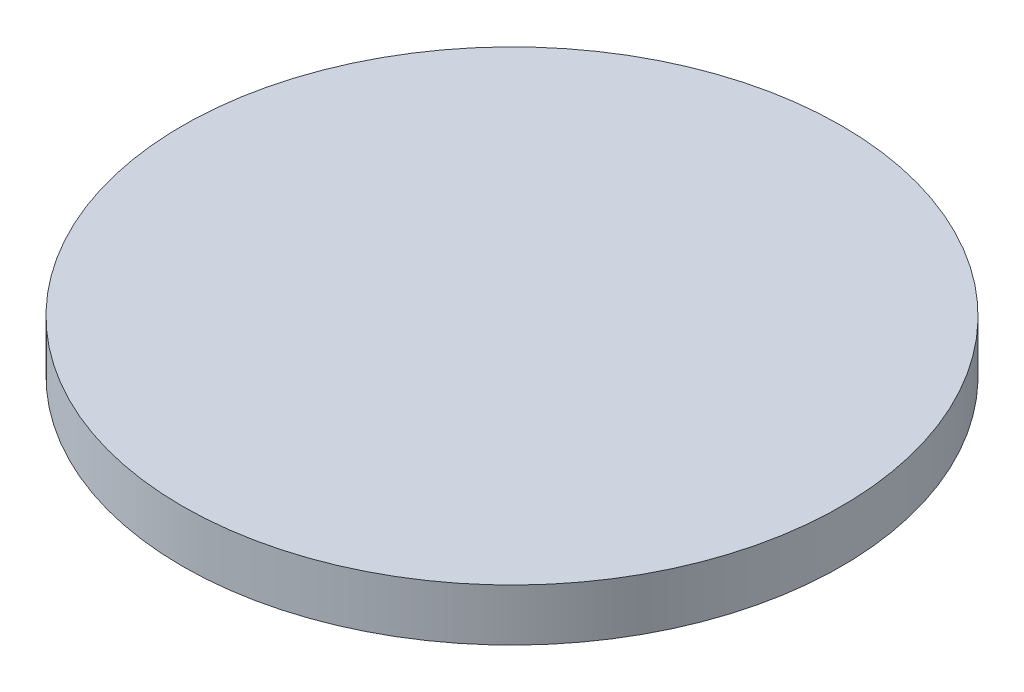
ISO-10303-21;
HEADER;
FILE_DESCRIPTION(('STEP AP214'),'2;1');
FILE_NAME('part.step','',(''),(''),'','','');
FILE_SCHEMA(('AUTOMOTIVE_DESIGN { 1 0 10303 214 1 1 1 1 }'));
ENDSEC;
DATA;
#1=APPLICATION_CONTEXT('core data for automotive mechanical design processes');
#2=APPLICATION_PROTOCOL_DEFINITION('international standard','automotive_design',2000,#1);
#3=PRODUCT_CONTEXT('',#1,'mechanical');
#4=PRODUCT('Part','Part','',(#3));
#5=PRODUCT_RELATED_PRODUCT_CATEGORY('part','',(#4));
#6=PRODUCT_DEFINITION_FORMATION('','',#4);
#7=PRODUCT_DEFINITION_CONTEXT('part definition',#1,'design');
#8=PRODUCT_DEFINITION('design','',#6,#7);
#9=PRODUCT_DEFINITION_SHAPE('','',#8);
#10=(LENGTH_UNIT() NAMED_UNIT(*) SI_UNIT(.MILLI.,.METRE.));
#11=(NAMED_UNIT(*) PLANE_ANGLE_UNIT() SI_UNIT($,.RADIAN.));
#12=(NAMED_UNIT(*) SI_UNIT($,.STERADIAN.) SOLID_ANGLE_UNIT());
#13=UNCERTAINTY_MEASURE_WITH_UNIT(LENGTH_MEASURE(1.E-05),#10,'distance_accuracy_value','');
#14=(GEOMETRIC_REPRESENTATION_CONTEXT(3) GLOBAL_UNCERTAINTY_ASSIGNED_CONTEXT((#13)) GLOBAL_UNIT_ASSIGNED_CONTEXT((#10,
#11,#12)) REPRESENTATION_CONTEXT('',''));
#15=CARTESIAN_POINT('',(0.,0.,0.));
#16=DIRECTION('',(0.,0.,1.));
#17=DIRECTION('',(1.,0.,0.));
#18=AXIS2_PLACEMENT_3D('',#15,#16,#17);
#19=CARTESIAN_POINT('',(0.,3.,0.));
#20=DIRECTION('',(0.,-1.,0.));
#21=DIRECTION('',(0.,0.,-1.));
#22=AXIS2_PLACEMENT_3D('',#19,#20,#21);
#23=CYLINDRICAL_SURFACE('',#22,19.);
#24=CARTESIAN_POINT('',(0.,3.,0.));
#25=DIRECTION('',(0.,1.,0.));
#26=DIRECTION('',(0.,0.,1.));
#27=AXIS2_PLACEMENT_3D('',#24,#25,#26);
#28=CIRCLE('',#27,19.);
#29=CARTESIAN_POINT('',(0.,3.,19.));
#30=VERTEX_POINT('',#29);
#31=EDGE_CURVE('E10',#30,#30,#28,.T.);
#32=ORIENTED_EDGE('',*,*,#31,.F.);
#33=EDGE_LOOP('',(#32));
#34=FACE_BOUND('',#33,.T.);
#35=CARTESIAN_POINT('',(0.,0.,0.));
#36=DIRECTION('',(0.,1.,0.));
#37=DIRECTION('',(0.,0.,1.));
#38=AXIS2_PLACEMENT_3D('',#35,#36,#37);
#39=CIRCLE('',#38,19.);
#40=CARTESIAN_POINT('',(0.,0.,19.));
#41=VERTEX_POINT('',#40);
#42=EDGE_CURVE('E40',#41,#41,#39,.T.);
#43=ORIENTED_EDGE('',*,*,#42,.T.);
#44=EDGE_LOOP('',(#43));
#45=FACE_BOUND('',#44,.T.);
#46=ADVANCED_FACE('F37',(#34,#45),#23,.T.);
#47=CARTESIAN_POINT('',(0.,3.,0.));
#48=DIRECTION('',(0.,1.,0.));
#49=DIRECTION('',(0.,0.,1.));
#50=AXIS2_PLACEMENT_3D('',#47,#48,#49);
#51=PLANE('',#50);
#52=ORIENTED_EDGE('',*,*,#31,.T.);
#53=EDGE_LOOP('',(#52));
#54=FACE_BOUND('',#53,.T.);
#55=ADVANCED_FACE('F52',(#54),#51,.T.);
#56=CARTESIAN_POINT('',(0.,0.,0.));
#57=DIRECTION('',(0.,1.,0.));
#58=DIRECTION('',(0.,0.,1.));
#59=AXIS2_PLACEMENT_3D('',#56,#57,#58);
#60=PLANE('',#59);
#61=ORIENTED_EDGE('',*,*,#42,.F.);
#62=EDGE_LOOP('',(#61));
#63=FACE_BOUND('',#62,.T.);
#64=ADVANCED_FACE('F50',(#63),#60,.F.);
#65=CLOSED_SHELL('',(#46,#55,#64));
#66=MANIFOLD_SOLID_BREP('B2',#65);
#67=ADVANCED_BREP_SHAPE_REPRESENTATION('',(#18,#66),#14);
#68=SHAPE_DEFINITION_REPRESENTATION(#9,#67);
ENDSEC;
END-ISO-10303-21;
